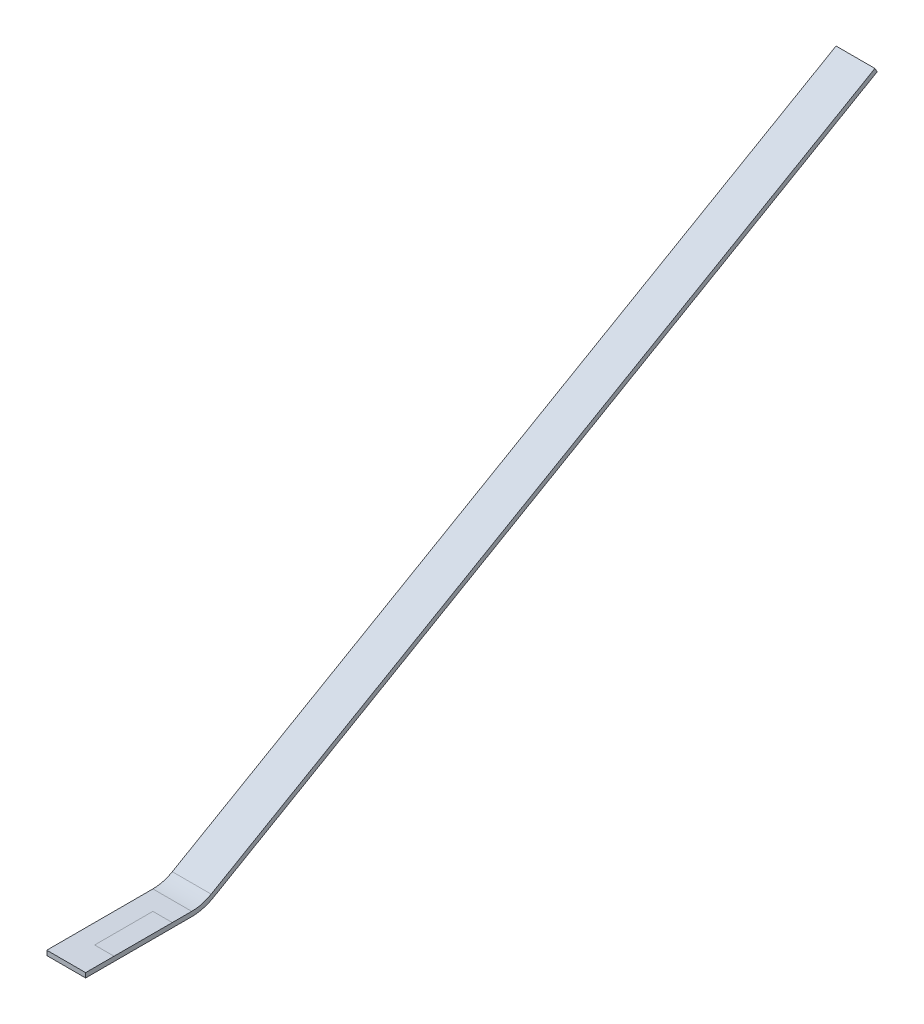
ISO-10303-21;
HEADER;
FILE_DESCRIPTION(('STEP AP214'),'2;1');
FILE_NAME('part.step','',(''),(''),'','','');
FILE_SCHEMA(('AUTOMOTIVE_DESIGN { 1 0 10303 214 1 1 1 1 }'));
ENDSEC;
DATA;
#1=APPLICATION_CONTEXT('core data for automotive mechanical design processes');
#2=APPLICATION_PROTOCOL_DEFINITION('international standard','automotive_design',2000,#1);
#3=PRODUCT_CONTEXT('',#1,'mechanical');
#4=PRODUCT('Part','Part','',(#3));
#5=PRODUCT_RELATED_PRODUCT_CATEGORY('part','',(#4));
#6=PRODUCT_DEFINITION_FORMATION('','',#4);
#7=PRODUCT_DEFINITION_CONTEXT('part definition',#1,'design');
#8=PRODUCT_DEFINITION('design','',#6,#7);
#9=PRODUCT_DEFINITION_SHAPE('','',#8);
#10=(LENGTH_UNIT() NAMED_UNIT(*) SI_UNIT(.MILLI.,.METRE.));
#11=(NAMED_UNIT(*) PLANE_ANGLE_UNIT() SI_UNIT($,.RADIAN.));
#12=(NAMED_UNIT(*) SI_UNIT($,.STERADIAN.) SOLID_ANGLE_UNIT());
#13=UNCERTAINTY_MEASURE_WITH_UNIT(LENGTH_MEASURE(1.E-05),#10,'distance_accuracy_value','');
#14=(GEOMETRIC_REPRESENTATION_CONTEXT(3) GLOBAL_UNCERTAINTY_ASSIGNED_CONTEXT((#13)) GLOBAL_UNIT_ASSIGNED_CONTEXT((#10,
#11,#12)) REPRESENTATION_CONTEXT('',''));
#15=CARTESIAN_POINT('',(0.,0.,0.));
#16=DIRECTION('',(0.,0.,1.));
#17=DIRECTION('',(1.,0.,0.));
#18=AXIS2_PLACEMENT_3D('',#15,#16,#17);
#19=CARTESIAN_POINT('',(6.35,0.,38.1));
#20=DIRECTION('',(0.,1.,0.));
#21=DIRECTION('',(0.,0.,1.));
#22=AXIS2_PLACEMENT_3D('',#19,#20,#21);
#23=PLANE('',#22);
#24=DIRECTION('',(0.,0.,1.));
#25=VECTOR('',#24,1.);
#26=CARTESIAN_POINT('',(0.,0.,38.1));
#27=LINE('',#26,#25);
#28=CARTESIAN_POINT('',(0.,0.,9.75295474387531));
#29=VERTEX_POINT('',#28);
#30=CARTESIAN_POINT('',(0.,0.,28.8029547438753));
#31=VERTEX_POINT('',#30);
#32=EDGE_CURVE('E42',#29,#31,#27,.T.);
#33=ORIENTED_EDGE('',*,*,#32,.T.);
#34=DIRECTION('',(1.,0.,0.));
#35=VECTOR('',#34,1.);
#36=CARTESIAN_POINT('',(6.35,0.,28.8029547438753));
#37=LINE('',#36,#35);
#38=CARTESIAN_POINT('',(6.35,0.,28.8029547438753));
#39=VERTEX_POINT('',#38);
#40=EDGE_CURVE('E11',#31,#39,#37,.T.);
#41=ORIENTED_EDGE('',*,*,#40,.T.);
#42=DIRECTION('',(0.,0.,-1.));
#43=VECTOR('',#42,1.);
#44=CARTESIAN_POINT('',(6.35,0.,38.1));
#45=LINE('',#44,#43);
#46=CARTESIAN_POINT('',(6.35,0.,9.75295474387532));
#47=VERTEX_POINT('',#46);
#48=EDGE_CURVE('E142',#39,#47,#45,.T.);
#49=ORIENTED_EDGE('',*,*,#48,.T.);
#50=DIRECTION('',(-1.,0.,0.));
#51=VECTOR('',#50,1.);
#52=CARTESIAN_POINT('',(6.35,0.,9.75295474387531));
#53=LINE('',#52,#51);
#54=EDGE_CURVE('E127',#47,#29,#53,.T.);
#55=ORIENTED_EDGE('',*,*,#54,.T.);
#56=EDGE_LOOP('',(#33,#41,#49,#55));
#57=FACE_BOUND('',#56,.T.);
#58=ADVANCED_FACE('F33',(#57),#23,.T.);
#59=CARTESIAN_POINT('',(6.35,0.381654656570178,-3.70904525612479));
#60=DIRECTION('',(0.,0.866025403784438,0.500000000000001));
#61=DIRECTION('',(0.,-0.500000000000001,0.866025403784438));
#62=AXIS2_PLACEMENT_3D('',#59,#60,#61);
#63=PLANE('',#62);
#64=DIRECTION('',(0.,0.500000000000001,-0.866025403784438));
#65=VECTOR('',#64,1.);
#66=CARTESIAN_POINT('',(-6.35,0.381654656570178,-3.70904525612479));
#67=LINE('',#66,#65);
#68=CARTESIAN_POINT('',(-6.35,0.381654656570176,-3.70904525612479));
#69=VERTEX_POINT('',#68);
#70=CARTESIAN_POINT('',(-6.35,125.680177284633,-220.732452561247));
#71=VERTEX_POINT('',#70);
#72=EDGE_CURVE('E123',#69,#71,#67,.T.);
#73=ORIENTED_EDGE('',*,*,#72,.T.);
#74=DIRECTION('',(-1.,0.,0.));
#75=VECTOR('',#74,1.);
#76=CARTESIAN_POINT('',(6.35,125.680177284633,-220.732452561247));
#77=LINE('',#76,#75);
#78=CARTESIAN_POINT('',(6.35,125.680177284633,-220.732452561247));
#79=VERTEX_POINT('',#78);
#80=EDGE_CURVE('E121',#79,#71,#77,.T.);
#81=ORIENTED_EDGE('',*,*,#80,.F.);
#82=DIRECTION('',(0.,0.500000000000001,-0.866025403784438));
#83=VECTOR('',#82,1.);
#84=CARTESIAN_POINT('',(6.35,0.381654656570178,-3.70904525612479));
#85=LINE('',#84,#83);
#86=CARTESIAN_POINT('',(6.35,0.381654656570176,-3.70904525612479));
#87=VERTEX_POINT('',#86);
#88=EDGE_CURVE('E106',#87,#79,#85,.T.);
#89=ORIENTED_EDGE('',*,*,#88,.F.);
#90=DIRECTION('',(-1.,0.,0.));
#91=VECTOR('',#90,1.);
#92=CARTESIAN_POINT('',(6.35,0.381654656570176,-3.70904525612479));
#93=LINE('',#92,#91);
#94=EDGE_CURVE('E148',#87,#69,#93,.T.);
#95=ORIENTED_EDGE('',*,*,#94,.T.);
#96=EDGE_LOOP('',(#73,#81,#89,#95));
#97=FACE_BOUND('',#96,.T.);
#98=ADVANCED_FACE('F35',(#97),#63,.F.);
#99=CARTESIAN_POINT('',(6.35,127.,-219.970452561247));
#100=DIRECTION('',(0.,0.500000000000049,-0.86602540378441));
#101=DIRECTION('',(0.,0.866025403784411,0.500000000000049));
#102=AXIS2_PLACEMENT_3D('',#99,#100,#101);
#103=PLANE('',#102);
#104=DIRECTION('',(0.,-0.86602540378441,-0.500000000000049));
#105=VECTOR('',#104,1.);
#106=CARTESIAN_POINT('',(-6.35,127.,-219.970452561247));
#107=LINE('',#106,#105);
#108=CARTESIAN_POINT('',(-6.35,127.,-219.970452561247));
#109=VERTEX_POINT('',#108);
#110=EDGE_CURVE('E150',#109,#71,#107,.T.);
#111=ORIENTED_EDGE('',*,*,#110,.F.);
#112=DIRECTION('',(-1.,0.,0.));
#113=VECTOR('',#112,1.);
#114=CARTESIAN_POINT('',(6.35,127.,-219.970452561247));
#115=LINE('',#114,#113);
#116=CARTESIAN_POINT('',(6.35,127.,-219.970452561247));
#117=VERTEX_POINT('',#116);
#118=EDGE_CURVE('E128',#117,#109,#115,.T.);
#119=ORIENTED_EDGE('',*,*,#118,.F.);
#120=DIRECTION('',(0.,-0.86602540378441,-0.500000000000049));
#121=VECTOR('',#120,1.);
#122=CARTESIAN_POINT('',(6.35,127.,-219.970452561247));
#123=LINE('',#122,#121);
#124=EDGE_CURVE('E111',#117,#79,#123,.T.);
#125=ORIENTED_EDGE('',*,*,#124,.T.);
#126=ORIENTED_EDGE('',*,*,#80,.T.);
#127=EDGE_LOOP('',(#111,#119,#125,#126));
#128=FACE_BOUND('',#127,.T.);
#129=ADVANCED_FACE('F130',(#128),#103,.T.);
#130=CARTESIAN_POINT('',(6.35,1.70147737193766,-2.94704525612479));
#131=DIRECTION('',(0.,0.866025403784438,0.500000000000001));
#132=DIRECTION('',(0.,-0.500000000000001,0.866025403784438));
#133=AXIS2_PLACEMENT_3D('',#130,#131,#132);
#134=PLANE('',#133);
#135=DIRECTION('',(0.,0.500000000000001,-0.866025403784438));
#136=VECTOR('',#135,1.);
#137=CARTESIAN_POINT('',(-6.35,1.70147737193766,-2.94704525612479));
#138=LINE('',#137,#136);
#139=CARTESIAN_POINT('',(-6.35,1.70147737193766,-2.94704525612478));
#140=VERTEX_POINT('',#139);
#141=EDGE_CURVE('E152',#140,#109,#138,.T.);
#142=ORIENTED_EDGE('',*,*,#141,.F.);
#143=DIRECTION('',(-1.,0.,0.));
#144=VECTOR('',#143,1.);
#145=CARTESIAN_POINT('',(6.35,1.70147737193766,-2.94704525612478));
#146=LINE('',#145,#144);
#147=CARTESIAN_POINT('',(6.35,1.70147737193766,-2.94704525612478));
#148=VERTEX_POINT('',#147);
#149=EDGE_CURVE('E177',#148,#140,#146,.T.);
#150=ORIENTED_EDGE('',*,*,#149,.F.);
#151=DIRECTION('',(0.,0.500000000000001,-0.866025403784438));
#152=VECTOR('',#151,1.);
#153=CARTESIAN_POINT('',(6.35,1.70147737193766,-2.94704525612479));
#154=LINE('',#153,#152);
#155=EDGE_CURVE('E131',#148,#117,#154,.T.);
#156=ORIENTED_EDGE('',*,*,#155,.T.);
#157=ORIENTED_EDGE('',*,*,#118,.T.);
#158=EDGE_LOOP('',(#142,#150,#156,#157));
#159=FACE_BOUND('',#158,.T.);
#160=ADVANCED_FACE('F212',(#159),#134,.T.);
#161=CARTESIAN_POINT('',(6.35,12.7,3.40295474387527));
#162=DIRECTION('',(-1.,0.,0.));
#163=DIRECTION('',(0.,0.,1.));
#164=AXIS2_PLACEMENT_3D('',#161,#162,#163);
#165=CYLINDRICAL_SURFACE('',#164,12.7);
#166=CARTESIAN_POINT('',(-6.35,12.7,3.40295474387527));
#167=DIRECTION('',(1.,0.,0.));
#168=DIRECTION('',(0.,0.,-1.));
#169=AXIS2_PLACEMENT_3D('',#166,#167,#168);
#170=CIRCLE('',#169,12.7);
#171=CARTESIAN_POINT('',(-6.35,0.,3.40295474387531));
#172=VERTEX_POINT('',#171);
#173=EDGE_CURVE('E155',#172,#140,#170,.T.);
#174=ORIENTED_EDGE('',*,*,#173,.F.);
#175=DIRECTION('',(-1.,0.,0.));
#176=VECTOR('',#175,1.);
#177=CARTESIAN_POINT('',(6.35,0.,3.40295474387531));
#178=LINE('',#177,#176);
#179=CARTESIAN_POINT('',(6.35,0.,3.40295474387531));
#180=VERTEX_POINT('',#179);
#181=EDGE_CURVE('E175',#180,#172,#178,.T.);
#182=ORIENTED_EDGE('',*,*,#181,.F.);
#183=CARTESIAN_POINT('',(6.35,12.7,3.40295474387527));
#184=DIRECTION('',(1.,0.,0.));
#185=DIRECTION('',(0.,0.,-1.));
#186=AXIS2_PLACEMENT_3D('',#183,#184,#185);
#187=CIRCLE('',#186,12.7);
#188=EDGE_CURVE('E133',#180,#148,#187,.T.);
#189=ORIENTED_EDGE('',*,*,#188,.T.);
#190=ORIENTED_EDGE('',*,*,#149,.T.);
#191=EDGE_LOOP('',(#174,#182,#189,#190));
#192=FACE_BOUND('',#191,.T.);
#193=ADVANCED_FACE('F194',(#192),#165,.F.);
#194=ORIENTED_EDGE('',*,*,#40,.F.);
#195=ORIENTED_EDGE('',*,*,#32,.F.);
#196=ORIENTED_EDGE('',*,*,#54,.F.);
#197=EDGE_CURVE('E138',#47,#180,#45,.T.);
#198=ORIENTED_EDGE('',*,*,#197,.T.);
#199=ORIENTED_EDGE('',*,*,#181,.T.);
#200=DIRECTION('',(0.,0.,-1.));
#201=VECTOR('',#200,1.);
#202=CARTESIAN_POINT('',(-6.35,0.,38.1));
#203=LINE('',#202,#201);
#204=CARTESIAN_POINT('',(-6.35,0.,38.1));
#205=VERTEX_POINT('',#204);
#206=EDGE_CURVE('E158',#205,#172,#203,.T.);
#207=ORIENTED_EDGE('',*,*,#206,.F.);
#208=DIRECTION('',(-1.,0.,0.));
#209=VECTOR('',#208,1.);
#210=CARTESIAN_POINT('',(6.35,0.,38.1));
#211=LINE('',#210,#209);
#212=CARTESIAN_POINT('',(6.35,0.,38.1));
#213=VERTEX_POINT('',#212);
#214=EDGE_CURVE('E173',#213,#205,#211,.T.);
#215=ORIENTED_EDGE('',*,*,#214,.F.);
#216=EDGE_CURVE('E139',#213,#39,#45,.T.);
#217=ORIENTED_EDGE('',*,*,#216,.T.);
#218=EDGE_LOOP('',(#194,#195,#196,#198,#199,#207,#215,#217));
#219=FACE_BOUND('',#218,.T.);
#220=ADVANCED_FACE('F188',(#219),#23,.T.);
#221=CARTESIAN_POINT('',(6.35,-1.524,38.1));
#222=DIRECTION('',(0.,0.,1.));
#223=DIRECTION('',(1.,0.,0.));
#224=AXIS2_PLACEMENT_3D('',#221,#222,#223);
#225=PLANE('',#224);
#226=DIRECTION('',(0.,1.,0.));
#227=VECTOR('',#226,1.);
#228=CARTESIAN_POINT('',(-6.35,-1.524,38.1));
#229=LINE('',#228,#227);
#230=CARTESIAN_POINT('',(-6.35,-1.524,38.1));
#231=VERTEX_POINT('',#230);
#232=EDGE_CURVE('E161',#231,#205,#229,.T.);
#233=ORIENTED_EDGE('',*,*,#232,.F.);
#234=DIRECTION('',(-1.,0.,0.));
#235=VECTOR('',#234,1.);
#236=CARTESIAN_POINT('',(6.35,-1.524,38.1));
#237=LINE('',#236,#235);
#238=CARTESIAN_POINT('',(6.35,-1.524,38.1));
#239=VERTEX_POINT('',#238);
#240=EDGE_CURVE('E171',#239,#231,#237,.T.);
#241=ORIENTED_EDGE('',*,*,#240,.F.);
#242=DIRECTION('',(0.,1.,0.));
#243=VECTOR('',#242,1.);
#244=CARTESIAN_POINT('',(6.35,-1.524,38.1));
#245=LINE('',#244,#243);
#246=EDGE_CURVE('E141',#239,#213,#245,.T.);
#247=ORIENTED_EDGE('',*,*,#246,.T.);
#248=ORIENTED_EDGE('',*,*,#214,.T.);
#249=EDGE_LOOP('',(#233,#241,#247,#248));
#250=FACE_BOUND('',#249,.T.);
#251=ADVANCED_FACE('F203',(#250),#225,.T.);
#252=CARTESIAN_POINT('',(6.35,-1.524,38.1));
#253=DIRECTION('',(0.,1.,0.));
#254=DIRECTION('',(0.,0.,1.));
#255=AXIS2_PLACEMENT_3D('',#252,#253,#254);
#256=PLANE('',#255);
#257=DIRECTION('',(0.,0.,-1.));
#258=VECTOR('',#257,1.);
#259=CARTESIAN_POINT('',(-6.35,-1.524,38.1));
#260=LINE('',#259,#258);
#261=CARTESIAN_POINT('',(-6.35,-1.524,3.40295474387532));
#262=VERTEX_POINT('',#261);
#263=EDGE_CURVE('E164',#231,#262,#260,.T.);
#264=ORIENTED_EDGE('',*,*,#263,.T.);
#265=DIRECTION('',(-1.,0.,0.));
#266=VECTOR('',#265,1.);
#267=CARTESIAN_POINT('',(6.35,-1.524,3.40295474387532));
#268=LINE('',#267,#266);
#269=CARTESIAN_POINT('',(6.35,-1.524,3.40295474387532));
#270=VERTEX_POINT('',#269);
#271=EDGE_CURVE('E168',#270,#262,#268,.T.);
#272=ORIENTED_EDGE('',*,*,#271,.F.);
#273=DIRECTION('',(0.,0.,-1.));
#274=VECTOR('',#273,1.);
#275=CARTESIAN_POINT('',(6.35,-1.524,38.1));
#276=LINE('',#275,#274);
#277=EDGE_CURVE('E145',#239,#270,#276,.T.);
#278=ORIENTED_EDGE('',*,*,#277,.F.);
#279=ORIENTED_EDGE('',*,*,#240,.T.);
#280=EDGE_LOOP('',(#264,#272,#278,#279));
#281=FACE_BOUND('',#280,.T.);
#282=ADVANCED_FACE('F208',(#281),#256,.F.);
#283=CARTESIAN_POINT('',(6.35,12.7,3.40295474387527));
#284=DIRECTION('',(-1.,0.,0.));
#285=DIRECTION('',(0.,0.,1.));
#286=AXIS2_PLACEMENT_3D('',#283,#284,#285);
#287=CYLINDRICAL_SURFACE('',#286,14.224);
#288=CARTESIAN_POINT('',(-6.35,12.7,3.40295474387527));
#289=DIRECTION('',(1.,0.,0.));
#290=DIRECTION('',(0.,0.,-1.));
#291=AXIS2_PLACEMENT_3D('',#288,#289,#290);
#292=CIRCLE('',#291,14.224);
#293=EDGE_CURVE('E118',#262,#69,#292,.T.);
#294=ORIENTED_EDGE('',*,*,#293,.T.);
#295=ORIENTED_EDGE('',*,*,#94,.F.);
#296=CARTESIAN_POINT('',(6.35,12.7,3.40295474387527));
#297=DIRECTION('',(1.,0.,0.));
#298=DIRECTION('',(0.,0.,-1.));
#299=AXIS2_PLACEMENT_3D('',#296,#297,#298);
#300=CIRCLE('',#299,14.224);
#301=EDGE_CURVE('E114',#270,#87,#300,.T.);
#302=ORIENTED_EDGE('',*,*,#301,.F.);
#303=ORIENTED_EDGE('',*,*,#271,.T.);
#304=EDGE_LOOP('',(#294,#295,#302,#303));
#305=FACE_BOUND('',#304,.T.);
#306=ADVANCED_FACE('F210',(#305),#287,.T.);
#307=CARTESIAN_POINT('',(6.35,12.7,3.40295474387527));
#308=DIRECTION('',(1.,0.,0.));
#309=DIRECTION('',(0.,0.,-1.));
#310=AXIS2_PLACEMENT_3D('',#307,#308,#309);
#311=PLANE('',#310);
#312=ORIENTED_EDGE('',*,*,#88,.T.);
#313=ORIENTED_EDGE('',*,*,#124,.F.);
#314=ORIENTED_EDGE('',*,*,#155,.F.);
#315=ORIENTED_EDGE('',*,*,#188,.F.);
#316=ORIENTED_EDGE('',*,*,#197,.F.);
#317=ORIENTED_EDGE('',*,*,#48,.F.);
#318=ORIENTED_EDGE('',*,*,#216,.F.);
#319=ORIENTED_EDGE('',*,*,#246,.F.);
#320=ORIENTED_EDGE('',*,*,#277,.T.);
#321=ORIENTED_EDGE('',*,*,#301,.T.);
#322=EDGE_LOOP('',(#312,#313,#314,#315,#316,#317,#318,#319,#320,#321));
#323=FACE_BOUND('',#322,.T.);
#324=ADVANCED_FACE('F108',(#323),#311,.T.);
#325=CARTESIAN_POINT('',(-6.35,12.7,3.40295474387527));
#326=DIRECTION('',(1.,0.,0.));
#327=DIRECTION('',(0.,0.,-1.));
#328=AXIS2_PLACEMENT_3D('',#325,#326,#327);
#329=PLANE('',#328);
#330=ORIENTED_EDGE('',*,*,#72,.F.);
#331=ORIENTED_EDGE('',*,*,#293,.F.);
#332=ORIENTED_EDGE('',*,*,#263,.F.);
#333=ORIENTED_EDGE('',*,*,#232,.T.);
#334=ORIENTED_EDGE('',*,*,#206,.T.);
#335=ORIENTED_EDGE('',*,*,#173,.T.);
#336=ORIENTED_EDGE('',*,*,#141,.T.);
#337=ORIENTED_EDGE('',*,*,#110,.T.);
#338=EDGE_LOOP('',(#330,#331,#332,#333,#334,#335,#336,#337));
#339=FACE_BOUND('',#338,.T.);
#340=ADVANCED_FACE('F200',(#339),#329,.F.);
#341=CLOSED_SHELL('',(#58,#98,#129,#160,#193,#220,#251,#282,#306,#324,#340));
#342=MANIFOLD_SOLID_BREP('B2',#341);
#343=ADVANCED_BREP_SHAPE_REPRESENTATION('',(#18,#342),#14);
#344=SHAPE_DEFINITION_REPRESENTATION(#9,#343);
ENDSEC;
END-ISO-10303-21;
